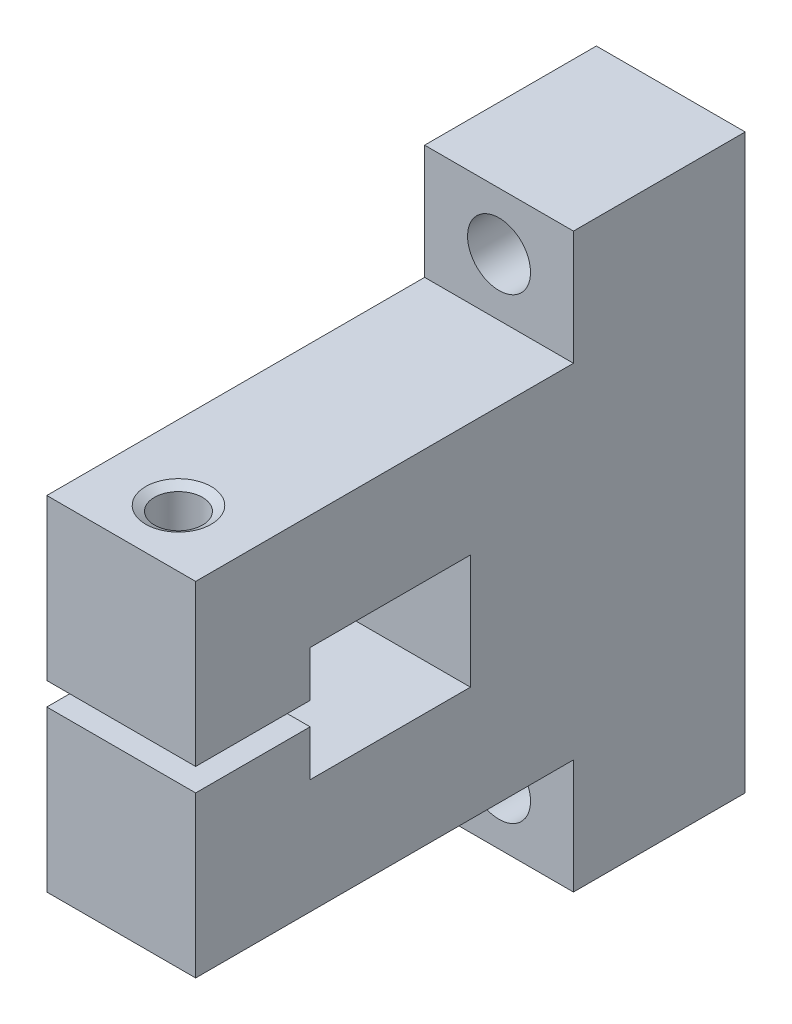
ISO-10303-21;
HEADER;
FILE_DESCRIPTION(('STEP AP214'),'2;1');
FILE_NAME('part.step','',(''),(''),'','','');
FILE_SCHEMA(('AUTOMOTIVE_DESIGN { 1 0 10303 214 1 1 1 1 }'));
ENDSEC;
DATA;
#1=APPLICATION_CONTEXT('core data for automotive mechanical design processes');
#2=APPLICATION_PROTOCOL_DEFINITION('international standard','automotive_design',2000,#1);
#3=PRODUCT_CONTEXT('',#1,'mechanical');
#4=PRODUCT('Part','Part','',(#3));
#5=PRODUCT_RELATED_PRODUCT_CATEGORY('part','',(#4));
#6=PRODUCT_DEFINITION_FORMATION('','',#4);
#7=PRODUCT_DEFINITION_CONTEXT('part definition',#1,'design');
#8=PRODUCT_DEFINITION('design','',#6,#7);
#9=PRODUCT_DEFINITION_SHAPE('','',#8);
#10=(LENGTH_UNIT() NAMED_UNIT(*) SI_UNIT(.MILLI.,.METRE.));
#11=(NAMED_UNIT(*) PLANE_ANGLE_UNIT() SI_UNIT($,.RADIAN.));
#12=(NAMED_UNIT(*) SI_UNIT($,.STERADIAN.) SOLID_ANGLE_UNIT());
#13=UNCERTAINTY_MEASURE_WITH_UNIT(LENGTH_MEASURE(1.E-05),#10,'distance_accuracy_value','');
#14=(GEOMETRIC_REPRESENTATION_CONTEXT(3) GLOBAL_UNCERTAINTY_ASSIGNED_CONTEXT((#13)) GLOBAL_UNIT_ASSIGNED_CONTEXT((#10,
#11,#12)) REPRESENTATION_CONTEXT('',''));
#15=CARTESIAN_POINT('',(0.,0.,0.));
#16=DIRECTION('',(0.,0.,1.));
#17=DIRECTION('',(1.,0.,0.));
#18=AXIS2_PLACEMENT_3D('',#15,#16,#17);
#19=CARTESIAN_POINT('',(6.5,0.,24.9999999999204));
#20=DIRECTION('',(0.,0.,-1.));
#21=DIRECTION('',(-1.,0.,0.));
#22=AXIS2_PLACEMENT_3D('',#19,#20,#21);
#23=CONICAL_SURFACE('',#22,2.49999999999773,1.02974425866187);
#24=CARTESIAN_POINT('',(6.5,-1.13686837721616E-10,26.5021515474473));
#25=VERTEX_POINT('',#24);
#26=VERTEX_LOOP('',#25);
#27=FACE_BOUND('',#26,.T.);
#28=CARTESIAN_POINT('',(6.5,0.,25.));
#29=DIRECTION('',(0.,0.,-1.));
#30=DIRECTION('',(0.,1.,0.));
#31=AXIS2_PLACEMENT_3D('',#28,#29,#30);
#32=CIRCLE('',#31,2.5);
#33=CARTESIAN_POINT('',(6.5,2.5,25.));
#34=VERTEX_POINT('',#33);
#35=EDGE_CURVE('E138',#34,#34,#32,.T.);
#36=ORIENTED_EDGE('',*,*,#35,.T.);
#37=EDGE_LOOP('',(#36));
#38=FACE_BOUND('',#37,.T.);
#39=ADVANCED_FACE('F16',(#27,#38),#23,.F.);
#40=CARTESIAN_POINT('',(6.5,-10.,58.));
#41=DIRECTION('',(0.,-1.,0.));
#42=DIRECTION('',(1.,0.,0.));
#43=AXIS2_PLACEMENT_3D('',#40,#41,#42);
#44=PLANE('',#43);
#45=CARTESIAN_POINT('',(6.5,-10.,58.));
#46=DIRECTION('',(0.,-1.,0.));
#47=DIRECTION('',(1.,0.,0.));
#48=AXIS2_PLACEMENT_3D('',#45,#46,#47);
#49=CIRCLE('',#48,2.75);
#50=CARTESIAN_POINT('',(9.25,-10.,58.));
#51=VERTEX_POINT('',#50);
#52=EDGE_CURVE('E143',#51,#51,#49,.F.);
#53=ORIENTED_EDGE('',*,*,#52,.T.);
#54=EDGE_LOOP('',(#53));
#55=FACE_BOUND('',#54,.T.);
#56=CARTESIAN_POINT('',(6.5,-10.,58.));
#57=DIRECTION('',(0.,-1.,0.));
#58=DIRECTION('',(1.,0.,0.));
#59=AXIS2_PLACEMENT_3D('',#56,#57,#58);
#60=CIRCLE('',#59,4.5);
#61=CARTESIAN_POINT('',(11.,-10.,58.));
#62=VERTEX_POINT('',#61);
#63=EDGE_CURVE('E19',#62,#62,#60,.T.);
#64=ORIENTED_EDGE('',*,*,#63,.T.);
#65=EDGE_LOOP('',(#64));
#66=FACE_BOUND('',#65,.T.);
#67=ADVANCED_FACE('F135',(#55,#66),#44,.T.);
#68=CARTESIAN_POINT('',(6.5,15.,58.));
#69=DIRECTION('',(0.,1.,0.));
#70=DIRECTION('',(-1.,0.,0.));
#71=AXIS2_PLACEMENT_3D('',#68,#69,#70);
#72=CYLINDRICAL_SURFACE('',#71,2.1);
#73=CARTESIAN_POINT('',(6.5,1.,58.));
#74=DIRECTION('',(0.,1.,0.));
#75=DIRECTION('',(-1.,0.,0.));
#76=AXIS2_PLACEMENT_3D('',#73,#74,#75);
#77=CIRCLE('',#76,2.1);
#78=CARTESIAN_POINT('',(4.4,1.,58.));
#79=VERTEX_POINT('',#78);
#80=EDGE_CURVE('E186',#79,#79,#77,.F.);
#81=ORIENTED_EDGE('',*,*,#80,.T.);
#82=EDGE_LOOP('',(#81));
#83=FACE_BOUND('',#82,.T.);
#84=CARTESIAN_POINT('',(6.5,14.5612137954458,58.));
#85=DIRECTION('',(0.,1.,0.));
#86=DIRECTION('',(1.,0.,0.));
#87=AXIS2_PLACEMENT_3D('',#84,#85,#86);
#88=CIRCLE('',#87,2.10000000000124);
#89=CARTESIAN_POINT('',(8.60000000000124,14.5612137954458,58.));
#90=VERTEX_POINT('',#89);
#91=EDGE_CURVE('E140',#90,#90,#88,.T.);
#92=ORIENTED_EDGE('',*,*,#91,.T.);
#93=EDGE_LOOP('',(#92));
#94=FACE_BOUND('',#93,.T.);
#95=ADVANCED_FACE('F428',(#83,#94),#72,.F.);
#96=CARTESIAN_POINT('',(6.5,14.9999999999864,58.));
#97=DIRECTION('',(0.,1.,0.));
#98=DIRECTION('',(0.,0.,1.));
#99=AXIS2_PLACEMENT_3D('',#96,#97,#98);
#100=CONICAL_SURFACE('',#99,2.85999999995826,1.04719755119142);
#101=CARTESIAN_POINT('',(6.5,15.0000000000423,58.));
#102=DIRECTION('',(0.,1.,0.));
#103=DIRECTION('',(0.,0.,1.));
#104=AXIS2_PLACEMENT_3D('',#101,#102,#103);
#105=CIRCLE('',#104,2.86000000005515);
#106=CARTESIAN_POINT('',(6.5,15.0000000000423,60.8600000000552));
#107=VERTEX_POINT('',#106);
#108=EDGE_CURVE('E181',#107,#107,#105,.T.);
#109=ORIENTED_EDGE('',*,*,#108,.T.);
#110=EDGE_LOOP('',(#109));
#111=FACE_BOUND('',#110,.T.);
#112=ORIENTED_EDGE('',*,*,#91,.F.);
#113=EDGE_LOOP('',(#112));
#114=FACE_BOUND('',#113,.T.);
#115=ADVANCED_FACE('F424',(#111,#114),#100,.F.);
#116=CARTESIAN_POINT('',(6.5,20.,30.));
#117=DIRECTION('',(0.,0.,1.));
#118=DIRECTION('',(0.,-1.,0.));
#119=AXIS2_PLACEMENT_3D('',#116,#117,#118);
#120=CYLINDRICAL_SURFACE('',#119,2.75);
#121=CARTESIAN_POINT('',(6.5,20.,15.));
#122=DIRECTION('',(0.,0.,1.));
#123=DIRECTION('',(0.,-1.,0.));
#124=AXIS2_PLACEMENT_3D('',#121,#122,#123);
#125=CIRCLE('',#124,2.75);
#126=CARTESIAN_POINT('',(6.5,17.25,15.));
#127=VERTEX_POINT('',#126);
#128=EDGE_CURVE('E169',#127,#127,#125,.F.);
#129=ORIENTED_EDGE('',*,*,#128,.T.);
#130=EDGE_LOOP('',(#129));
#131=FACE_BOUND('',#130,.T.);
#132=CARTESIAN_POINT('',(6.5,20.,30.));
#133=DIRECTION('',(0.,0.,1.));
#134=DIRECTION('',(0.,-1.,0.));
#135=AXIS2_PLACEMENT_3D('',#132,#133,#134);
#136=CIRCLE('',#135,2.75);
#137=CARTESIAN_POINT('',(6.5,17.25,30.));
#138=VERTEX_POINT('',#137);
#139=EDGE_CURVE('E176',#138,#138,#136,.F.);
#140=ORIENTED_EDGE('',*,*,#139,.F.);
#141=EDGE_LOOP('',(#140));
#142=FACE_BOUND('',#141,.T.);
#143=ADVANCED_FACE('F421',(#131,#142),#120,.F.);
#144=CARTESIAN_POINT('',(6.5,0.,15.));
#145=DIRECTION('',(0.,0.,-1.));
#146=DIRECTION('',(0.,1.,0.));
#147=AXIS2_PLACEMENT_3D('',#144,#145,#146);
#148=CYLINDRICAL_SURFACE('',#147,2.5);
#149=ORIENTED_EDGE('',*,*,#35,.F.);
#150=EDGE_LOOP('',(#149));
#151=FACE_BOUND('',#150,.T.);
#152=CARTESIAN_POINT('',(6.5,0.,15.));
#153=DIRECTION('',(0.,0.,-1.));
#154=DIRECTION('',(0.,1.,0.));
#155=AXIS2_PLACEMENT_3D('',#152,#153,#154);
#156=CIRCLE('',#155,2.5);
#157=CARTESIAN_POINT('',(6.5,2.50000000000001,15.));
#158=VERTEX_POINT('',#157);
#159=EDGE_CURVE('E165',#158,#158,#156,.T.);
#160=ORIENTED_EDGE('',*,*,#159,.T.);
#161=EDGE_LOOP('',(#160));
#162=FACE_BOUND('',#161,.T.);
#163=ADVANCED_FACE('F417',(#151,#162),#148,.F.);
#164=CARTESIAN_POINT('',(6.5,-20.,30.));
#165=DIRECTION('',(0.,0.,1.));
#166=DIRECTION('',(0.,-1.,0.));
#167=AXIS2_PLACEMENT_3D('',#164,#165,#166);
#168=CYLINDRICAL_SURFACE('',#167,2.75);
#169=CARTESIAN_POINT('',(6.5,-20.,15.));
#170=DIRECTION('',(0.,0.,1.));
#171=DIRECTION('',(0.,-1.,0.));
#172=AXIS2_PLACEMENT_3D('',#169,#170,#171);
#173=CIRCLE('',#172,2.75);
#174=CARTESIAN_POINT('',(6.5,-22.75,15.));
#175=VERTEX_POINT('',#174);
#176=EDGE_CURVE('E172',#175,#175,#173,.F.);
#177=ORIENTED_EDGE('',*,*,#176,.T.);
#178=EDGE_LOOP('',(#177));
#179=FACE_BOUND('',#178,.T.);
#180=CARTESIAN_POINT('',(6.5,-20.,30.));
#181=DIRECTION('',(0.,0.,1.));
#182=DIRECTION('',(0.,-1.,0.));
#183=AXIS2_PLACEMENT_3D('',#180,#181,#182);
#184=CIRCLE('',#183,2.75);
#185=CARTESIAN_POINT('',(6.5,-22.75,30.));
#186=VERTEX_POINT('',#185);
#187=EDGE_CURVE('E160',#186,#186,#184,.F.);
#188=ORIENTED_EDGE('',*,*,#187,.F.);
#189=EDGE_LOOP('',(#188));
#190=FACE_BOUND('',#189,.T.);
#191=ADVANCED_FACE('F413',(#179,#190),#168,.F.);
#192=CARTESIAN_POINT('',(6.5,-15.,58.));
#193=DIRECTION('',(0.,-1.,0.));
#194=DIRECTION('',(1.,0.,0.));
#195=AXIS2_PLACEMENT_3D('',#192,#193,#194);
#196=CYLINDRICAL_SURFACE('',#195,4.5);
#197=ORIENTED_EDGE('',*,*,#63,.F.);
#198=EDGE_LOOP('',(#197));
#199=FACE_BOUND('',#198,.T.);
#200=CARTESIAN_POINT('',(6.5,-15.,58.));
#201=DIRECTION('',(0.,-1.,0.));
#202=DIRECTION('',(1.,0.,0.));
#203=AXIS2_PLACEMENT_3D('',#200,#201,#202);
#204=CIRCLE('',#203,4.5);
#205=CARTESIAN_POINT('',(11.,-15.,58.));
#206=VERTEX_POINT('',#205);
#207=EDGE_CURVE('E155',#206,#206,#204,.T.);
#208=ORIENTED_EDGE('',*,*,#207,.T.);
#209=EDGE_LOOP('',(#208));
#210=FACE_BOUND('',#209,.T.);
#211=ADVANCED_FACE('F409',(#199,#210),#196,.F.);
#212=CARTESIAN_POINT('',(6.5,-15.,58.));
#213=DIRECTION('',(0.,-1.,0.));
#214=DIRECTION('',(1.,0.,0.));
#215=AXIS2_PLACEMENT_3D('',#212,#213,#214);
#216=CYLINDRICAL_SURFACE('',#215,2.75);
#217=CARTESIAN_POINT('',(6.5,-1.,58.));
#218=DIRECTION('',(0.,-1.,0.));
#219=DIRECTION('',(1.,0.,0.));
#220=AXIS2_PLACEMENT_3D('',#217,#218,#219);
#221=CIRCLE('',#220,2.75);
#222=CARTESIAN_POINT('',(9.25,-1.,58.));
#223=VERTEX_POINT('',#222);
#224=EDGE_CURVE('E150',#223,#223,#221,.F.);
#225=ORIENTED_EDGE('',*,*,#224,.T.);
#226=EDGE_LOOP('',(#225));
#227=FACE_BOUND('',#226,.T.);
#228=ORIENTED_EDGE('',*,*,#52,.F.);
#229=EDGE_LOOP('',(#228));
#230=FACE_BOUND('',#229,.T.);
#231=ADVANCED_FACE('F406',(#227,#230),#216,.F.);
#232=CARTESIAN_POINT('',(13.,0.,25.9999999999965));
#233=DIRECTION('',(-1.,0.,0.));
#234=DIRECTION('',(0.,-1.,0.));
#235=AXIS2_PLACEMENT_3D('',#232,#233,#234);
#236=PLANE('',#235);
#237=DIRECTION('',(0.,0.,-1.));
#238=VECTOR('',#237,1.);
#239=CARTESIAN_POINT('',(13.,-4.99999999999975,48.000000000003));
#240=LINE('',#239,#238);
#241=CARTESIAN_POINT('',(13.,-4.99999999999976,38.999999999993));
#242=VERTEX_POINT('',#241);
#243=CARTESIAN_POINT('',(13.,-4.99999999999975,52.999999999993));
#244=VERTEX_POINT('',#243);
#245=EDGE_CURVE('E245',#242,#244,#240,.F.);
#246=ORIENTED_EDGE('',*,*,#245,.T.);
#247=DIRECTION('',(0.,-1.,0.));
#248=VECTOR('',#247,1.);
#249=CARTESIAN_POINT('',(13.,6.00000000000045,52.999999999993));
#250=LINE('',#249,#248);
#251=CARTESIAN_POINT('',(13.,-1.,52.999999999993));
#252=VERTEX_POINT('',#251);
#253=EDGE_CURVE('E239',#244,#252,#250,.F.);
#254=ORIENTED_EDGE('',*,*,#253,.T.);
#255=DIRECTION('',(0.,0.,-1.));
#256=VECTOR('',#255,1.);
#257=CARTESIAN_POINT('',(13.,-1.,76.));
#258=LINE('',#257,#256);
#259=CARTESIAN_POINT('',(13.,-1.,63.));
#260=VERTEX_POINT('',#259);
#261=EDGE_CURVE('E153',#252,#260,#258,.F.);
#262=ORIENTED_EDGE('',*,*,#261,.T.);
#263=DIRECTION('',(0.,1.,0.));
#264=VECTOR('',#263,1.);
#265=CARTESIAN_POINT('',(13.,21.,63.));
#266=LINE('',#265,#264);
#267=CARTESIAN_POINT('',(13.,-15.,63.));
#268=VERTEX_POINT('',#267);
#269=EDGE_CURVE('E233',#260,#268,#266,.F.);
#270=ORIENTED_EDGE('',*,*,#269,.T.);
#271=DIRECTION('',(0.,0.,1.));
#272=VECTOR('',#271,1.);
#273=CARTESIAN_POINT('',(13.,-15.,64.));
#274=LINE('',#273,#272);
#275=CARTESIAN_POINT('',(13.,-15.,30.));
#276=VERTEX_POINT('',#275);
#277=EDGE_CURVE('E158',#268,#276,#274,.F.);
#278=ORIENTED_EDGE('',*,*,#277,.T.);
#279=DIRECTION('',(0.,-1.,0.));
#280=VECTOR('',#279,1.);
#281=CARTESIAN_POINT('',(13.,-25.,30.));
#282=LINE('',#281,#280);
#283=CARTESIAN_POINT('',(13.,-25.,30.));
#284=VERTEX_POINT('',#283);
#285=EDGE_CURVE('E159',#284,#276,#282,.F.);
#286=ORIENTED_EDGE('',*,*,#285,.F.);
#287=DIRECTION('',(0.,0.,-1.));
#288=VECTOR('',#287,1.);
#289=CARTESIAN_POINT('',(13.,-25.,23.));
#290=LINE('',#289,#288);
#291=CARTESIAN_POINT('',(13.,-25.,15.));
#292=VERTEX_POINT('',#291);
#293=EDGE_CURVE('E164',#292,#284,#290,.F.);
#294=ORIENTED_EDGE('',*,*,#293,.F.);
#295=DIRECTION('',(0.,-1.,0.));
#296=VECTOR('',#295,1.);
#297=CARTESIAN_POINT('',(13.,-21.,15.));
#298=LINE('',#297,#296);
#299=CARTESIAN_POINT('',(13.,25.,15.));
#300=VERTEX_POINT('',#299);
#301=EDGE_CURVE('E219',#292,#300,#298,.F.);
#302=ORIENTED_EDGE('',*,*,#301,.T.);
#303=DIRECTION('',(0.,0.,-1.));
#304=VECTOR('',#303,1.);
#305=CARTESIAN_POINT('',(13.,25.,-62.));
#306=LINE('',#305,#304);
#307=CARTESIAN_POINT('',(13.,25.,30.));
#308=VERTEX_POINT('',#307);
#309=EDGE_CURVE('E175',#300,#308,#306,.F.);
#310=ORIENTED_EDGE('',*,*,#309,.T.);
#311=DIRECTION('',(0.,-1.,0.));
#312=VECTOR('',#311,1.);
#313=CARTESIAN_POINT('',(13.,15.,30.));
#314=LINE('',#313,#312);
#315=CARTESIAN_POINT('',(13.,15.,30.));
#316=VERTEX_POINT('',#315);
#317=EDGE_CURVE('E212',#316,#308,#314,.F.);
#318=ORIENTED_EDGE('',*,*,#317,.F.);
#319=DIRECTION('',(0.,0.,-1.));
#320=VECTOR('',#319,1.);
#321=CARTESIAN_POINT('',(13.,15.,64.));
#322=LINE('',#321,#320);
#323=CARTESIAN_POINT('',(13.,15.,63.));
#324=VERTEX_POINT('',#323);
#325=EDGE_CURVE('E180',#316,#324,#322,.F.);
#326=ORIENTED_EDGE('',*,*,#325,.T.);
#327=DIRECTION('',(0.,1.,0.));
#328=VECTOR('',#327,1.);
#329=CARTESIAN_POINT('',(13.,21.,63.));
#330=LINE('',#329,#328);
#331=CARTESIAN_POINT('',(13.,1.,63.));
#332=VERTEX_POINT('',#331);
#333=EDGE_CURVE('E185',#324,#332,#330,.F.);
#334=ORIENTED_EDGE('',*,*,#333,.T.);
#335=DIRECTION('',(0.,0.,1.));
#336=VECTOR('',#335,1.);
#337=CARTESIAN_POINT('',(13.,1.,76.));
#338=LINE('',#337,#336);
#339=CARTESIAN_POINT('',(13.,1.,52.999999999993));
#340=VERTEX_POINT('',#339);
#341=EDGE_CURVE('E188',#332,#340,#338,.F.);
#342=ORIENTED_EDGE('',*,*,#341,.T.);
#343=DIRECTION('',(0.,-1.,0.));
#344=VECTOR('',#343,1.);
#345=CARTESIAN_POINT('',(13.,6.00000000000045,52.999999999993));
#346=LINE('',#345,#344);
#347=CARTESIAN_POINT('',(13.,5.00000000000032,52.999999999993));
#348=VERTEX_POINT('',#347);
#349=EDGE_CURVE('E195',#340,#348,#346,.F.);
#350=ORIENTED_EDGE('',*,*,#349,.T.);
#351=DIRECTION('',(0.,0.,1.));
#352=VECTOR('',#351,1.);
#353=CARTESIAN_POINT('',(13.,4.99999999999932,-1193.84071877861));
#354=LINE('',#353,#352);
#355=CARTESIAN_POINT('',(13.,5.00000000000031,38.999999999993));
#356=VERTEX_POINT('',#355);
#357=EDGE_CURVE('E129',#348,#356,#354,.F.);
#358=ORIENTED_EDGE('',*,*,#357,.T.);
#359=DIRECTION('',(0.,1.,0.));
#360=VECTOR('',#359,1.);
#361=CARTESIAN_POINT('',(13.,-5.99999999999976,38.999999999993));
#362=LINE('',#361,#360);
#363=EDGE_CURVE('E147',#356,#242,#362,.F.);
#364=ORIENTED_EDGE('',*,*,#363,.T.);
#365=EDGE_LOOP('',(#246,#254,#262,#270,#278,#286,#294,#302,#310,#318,#326,#334,#342,#350,#358,#364));
#366=FACE_BOUND('',#365,.T.);
#367=ADVANCED_FACE('F302',(#366),#236,.F.);
#368=CARTESIAN_POINT('',(14.9999999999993,-5.99999999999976,38.999999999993));
#369=DIRECTION('',(0.,0.,-1.));
#370=DIRECTION('',(0.,1.,0.));
#371=AXIS2_PLACEMENT_3D('',#368,#369,#370);
#372=PLANE('',#371);
#373=DIRECTION('',(1.,0.,0.));
#374=VECTOR('',#373,1.);
#375=CARTESIAN_POINT('',(-511.311282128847,5.00000000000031,38.9999999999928));
#376=LINE('',#375,#374);
#377=CARTESIAN_POINT('',(0.,5.00000000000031,38.999999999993));
#378=VERTEX_POINT('',#377);
#379=EDGE_CURVE('E194',#356,#378,#376,.F.);
#380=ORIENTED_EDGE('',*,*,#379,.T.);
#381=DIRECTION('',(0.,-1.,0.));
#382=VECTOR('',#381,1.);
#383=CARTESIAN_POINT('',(0.,0.,38.999999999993));
#384=LINE('',#383,#382);
#385=CARTESIAN_POINT('',(0.,-4.99999999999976,38.999999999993));
#386=VERTEX_POINT('',#385);
#387=EDGE_CURVE('E248',#386,#378,#384,.F.);
#388=ORIENTED_EDGE('',*,*,#387,.F.);
#389=DIRECTION('',(1.,0.,0.));
#390=VECTOR('',#389,1.);
#391=CARTESIAN_POINT('',(14.9999999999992,-4.99999999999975,38.999999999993));
#392=LINE('',#391,#390);
#393=EDGE_CURVE('E243',#386,#242,#392,.T.);
#394=ORIENTED_EDGE('',*,*,#393,.T.);
#395=ORIENTED_EDGE('',*,*,#363,.F.);
#396=EDGE_LOOP('',(#380,#388,#394,#395));
#397=FACE_BOUND('',#396,.T.);
#398=ADVANCED_FACE('F360',(#397),#372,.F.);
#399=CARTESIAN_POINT('',(-511.311282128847,4.99999999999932,-1193.84071877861));
#400=DIRECTION('',(0.,1.,0.));
#401=DIRECTION('',(0.,0.,1.));
#402=AXIS2_PLACEMENT_3D('',#399,#400,#401);
#403=PLANE('',#402);
#404=ORIENTED_EDGE('',*,*,#379,.F.);
#405=ORIENTED_EDGE('',*,*,#357,.F.);
#406=DIRECTION('',(1.,0.,0.));
#407=VECTOR('',#406,1.);
#408=CARTESIAN_POINT('',(14.9999999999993,5.00000000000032,52.999999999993));
#409=LINE('',#408,#407);
#410=CARTESIAN_POINT('',(0.,5.00000000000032,52.999999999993));
#411=VERTEX_POINT('',#410);
#412=EDGE_CURVE('E189',#348,#411,#409,.F.);
#413=ORIENTED_EDGE('',*,*,#412,.T.);
#414=DIRECTION('',(0.,0.,1.));
#415=VECTOR('',#414,1.);
#416=CARTESIAN_POINT('',(0.,5.00000000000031,25.9999999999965));
#417=LINE('',#416,#415);
#418=EDGE_CURVE('E251',#378,#411,#417,.T.);
#419=ORIENTED_EDGE('',*,*,#418,.F.);
#420=EDGE_LOOP('',(#404,#405,#413,#419));
#421=FACE_BOUND('',#420,.T.);
#422=ADVANCED_FACE('F358',(#421),#403,.F.);
#423=CARTESIAN_POINT('',(14.9999999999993,6.00000000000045,52.999999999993));
#424=DIRECTION('',(0.,0.,1.));
#425=DIRECTION('',(0.,-1.,0.));
#426=AXIS2_PLACEMENT_3D('',#423,#424,#425);
#427=PLANE('',#426);
#428=ORIENTED_EDGE('',*,*,#412,.F.);
#429=ORIENTED_EDGE('',*,*,#349,.F.);
#430=DIRECTION('',(1.,0.,0.));
#431=VECTOR('',#430,1.);
#432=CARTESIAN_POINT('',(-5.,1.,52.999999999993));
#433=LINE('',#432,#431);
#434=CARTESIAN_POINT('',(0.,1.,52.999999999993));
#435=VERTEX_POINT('',#434);
#436=EDGE_CURVE('E201',#340,#435,#433,.F.);
#437=ORIENTED_EDGE('',*,*,#436,.T.);
#438=DIRECTION('',(0.,-1.,0.));
#439=VECTOR('',#438,1.);
#440=CARTESIAN_POINT('',(0.,0.,52.999999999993));
#441=LINE('',#440,#439);
#442=EDGE_CURVE('E254',#411,#435,#441,.T.);
#443=ORIENTED_EDGE('',*,*,#442,.F.);
#444=EDGE_LOOP('',(#428,#429,#437,#443));
#445=FACE_BOUND('',#444,.T.);
#446=ADVANCED_FACE('F353',(#445),#427,.F.);
#447=CARTESIAN_POINT('',(-5.,1.,76.));
#448=DIRECTION('',(0.,1.,0.));
#449=DIRECTION('',(0.,0.,1.));
#450=AXIS2_PLACEMENT_3D('',#447,#448,#449);
#451=PLANE('',#450);
#452=ORIENTED_EDGE('',*,*,#341,.F.);
#453=DIRECTION('',(-1.,0.,0.));
#454=VECTOR('',#453,1.);
#455=CARTESIAN_POINT('',(15.,1.,63.));
#456=LINE('',#455,#454);
#457=CARTESIAN_POINT('',(0.,1.,63.));
#458=VERTEX_POINT('',#457);
#459=EDGE_CURVE('E203',#332,#458,#456,.T.);
#460=ORIENTED_EDGE('',*,*,#459,.T.);
#461=DIRECTION('',(0.,0.,1.));
#462=VECTOR('',#461,1.);
#463=CARTESIAN_POINT('',(0.,1.,25.9999999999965));
#464=LINE('',#463,#462);
#465=EDGE_CURVE('E257',#435,#458,#464,.T.);
#466=ORIENTED_EDGE('',*,*,#465,.F.);
#467=ORIENTED_EDGE('',*,*,#436,.F.);
#468=EDGE_LOOP('',(#452,#460,#466,#467));
#469=FACE_BOUND('',#468,.T.);
#470=ORIENTED_EDGE('',*,*,#80,.F.);
#471=EDGE_LOOP('',(#470));
#472=FACE_BOUND('',#471,.T.);
#473=ADVANCED_FACE('F347',(#469,#472),#451,.F.);
#474=CARTESIAN_POINT('',(15.,21.,63.));
#475=DIRECTION('',(0.,0.,-1.));
#476=DIRECTION('',(-1.,0.,0.));
#477=AXIS2_PLACEMENT_3D('',#474,#475,#476);
#478=PLANE('',#477);
#479=DIRECTION('',(1.,0.,0.));
#480=VECTOR('',#479,1.);
#481=CARTESIAN_POINT('',(-5.,15.,63.));
#482=LINE('',#481,#480);
#483=CARTESIAN_POINT('',(0.,15.,63.));
#484=VERTEX_POINT('',#483);
#485=EDGE_CURVE('E184',#324,#484,#482,.F.);
#486=ORIENTED_EDGE('',*,*,#485,.T.);
#487=DIRECTION('',(0.,-1.,0.));
#488=VECTOR('',#487,1.);
#489=CARTESIAN_POINT('',(0.,0.,63.));
#490=LINE('',#489,#488);
#491=EDGE_CURVE('E260',#458,#484,#490,.F.);
#492=ORIENTED_EDGE('',*,*,#491,.F.);
#493=ORIENTED_EDGE('',*,*,#459,.F.);
#494=ORIENTED_EDGE('',*,*,#333,.F.);
#495=EDGE_LOOP('',(#486,#492,#493,#494));
#496=FACE_BOUND('',#495,.T.);
#497=ADVANCED_FACE('F344',(#496),#478,.F.);
#498=CARTESIAN_POINT('',(-5.,15.,64.));
#499=DIRECTION('',(0.,-1.,0.));
#500=DIRECTION('',(0.,0.,-1.));
#501=AXIS2_PLACEMENT_3D('',#498,#499,#500);
#502=PLANE('',#501);
#503=DIRECTION('',(1.,0.,0.));
#504=VECTOR('',#503,1.);
#505=CARTESIAN_POINT('',(0.,15.,30.));
#506=LINE('',#505,#504);
#507=CARTESIAN_POINT('',(0.,15.,30.));
#508=VERTEX_POINT('',#507);
#509=EDGE_CURVE('E179',#508,#316,#506,.T.);
#510=ORIENTED_EDGE('',*,*,#509,.F.);
#511=DIRECTION('',(0.,0.,1.));
#512=VECTOR('',#511,1.);
#513=CARTESIAN_POINT('',(0.,15.,25.9999999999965));
#514=LINE('',#513,#512);
#515=EDGE_CURVE('E263',#484,#508,#514,.F.);
#516=ORIENTED_EDGE('',*,*,#515,.F.);
#517=ORIENTED_EDGE('',*,*,#485,.F.);
#518=ORIENTED_EDGE('',*,*,#325,.F.);
#519=EDGE_LOOP('',(#510,#516,#517,#518));
#520=FACE_BOUND('',#519,.T.);
#521=ORIENTED_EDGE('',*,*,#108,.F.);
#522=EDGE_LOOP('',(#521));
#523=FACE_BOUND('',#522,.T.);
#524=ADVANCED_FACE('F340',(#520,#523),#502,.F.);
#525=CARTESIAN_POINT('',(0.,15.,30.));
#526=DIRECTION('',(0.,0.,1.));
#527=DIRECTION('',(0.,-1.,0.));
#528=AXIS2_PLACEMENT_3D('',#525,#526,#527);
#529=PLANE('',#528);
#530=ORIENTED_EDGE('',*,*,#317,.T.);
#531=DIRECTION('',(1.,0.,0.));
#532=VECTOR('',#531,1.);
#533=CARTESIAN_POINT('',(15.,25.,30.));
#534=LINE('',#533,#532);
#535=CARTESIAN_POINT('',(0.,25.,30.));
#536=VERTEX_POINT('',#535);
#537=EDGE_CURVE('E214',#308,#536,#534,.F.);
#538=ORIENTED_EDGE('',*,*,#537,.T.);
#539=DIRECTION('',(0.,-1.,0.));
#540=VECTOR('',#539,1.);
#541=CARTESIAN_POINT('',(0.,0.,30.));
#542=LINE('',#541,#540);
#543=EDGE_CURVE('E266',#508,#536,#542,.F.);
#544=ORIENTED_EDGE('',*,*,#543,.F.);
#545=ORIENTED_EDGE('',*,*,#509,.T.);
#546=EDGE_LOOP('',(#530,#538,#544,#545));
#547=FACE_BOUND('',#546,.T.);
#548=ORIENTED_EDGE('',*,*,#139,.T.);
#549=EDGE_LOOP('',(#548));
#550=FACE_BOUND('',#549,.T.);
#551=ADVANCED_FACE('F334',(#547,#550),#529,.T.);
#552=CARTESIAN_POINT('',(15.,25.,-62.));
#553=DIRECTION('',(0.,-1.,0.));
#554=DIRECTION('',(0.,0.,-1.));
#555=AXIS2_PLACEMENT_3D('',#552,#553,#554);
#556=PLANE('',#555);
#557=DIRECTION('',(1.,0.,0.));
#558=VECTOR('',#557,1.);
#559=CARTESIAN_POINT('',(-15.,25.,15.));
#560=LINE('',#559,#558);
#561=CARTESIAN_POINT('',(0.,25.,15.));
#562=VERTEX_POINT('',#561);
#563=EDGE_CURVE('E168',#300,#562,#560,.F.);
#564=ORIENTED_EDGE('',*,*,#563,.T.);
#565=DIRECTION('',(0.,0.,1.));
#566=VECTOR('',#565,1.);
#567=CARTESIAN_POINT('',(0.,25.,25.9999999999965));
#568=LINE('',#567,#566);
#569=EDGE_CURVE('E269',#536,#562,#568,.F.);
#570=ORIENTED_EDGE('',*,*,#569,.F.);
#571=ORIENTED_EDGE('',*,*,#537,.F.);
#572=ORIENTED_EDGE('',*,*,#309,.F.);
#573=EDGE_LOOP('',(#564,#570,#571,#572));
#574=FACE_BOUND('',#573,.T.);
#575=ADVANCED_FACE('F331',(#574),#556,.F.);
#576=CARTESIAN_POINT('',(-15.,-21.,15.));
#577=DIRECTION('',(0.,0.,1.));
#578=DIRECTION('',(0.,-1.,0.));
#579=AXIS2_PLACEMENT_3D('',#576,#577,#578);
#580=PLANE('',#579);
#581=DIRECTION('',(1.,0.,0.));
#582=VECTOR('',#581,1.);
#583=CARTESIAN_POINT('',(0.,-25.,15.));
#584=LINE('',#583,#582);
#585=CARTESIAN_POINT('',(0.,-25.,15.));
#586=VERTEX_POINT('',#585);
#587=EDGE_CURVE('E222',#586,#292,#584,.T.);
#588=ORIENTED_EDGE('',*,*,#587,.F.);
#589=DIRECTION('',(0.,-1.,0.));
#590=VECTOR('',#589,1.);
#591=CARTESIAN_POINT('',(0.,0.,15.));
#592=LINE('',#591,#590);
#593=EDGE_CURVE('E272',#562,#586,#592,.T.);
#594=ORIENTED_EDGE('',*,*,#593,.F.);
#595=ORIENTED_EDGE('',*,*,#563,.F.);
#596=ORIENTED_EDGE('',*,*,#301,.F.);
#597=EDGE_LOOP('',(#588,#594,#595,#596));
#598=FACE_BOUND('',#597,.T.);
#599=ORIENTED_EDGE('',*,*,#159,.F.);
#600=EDGE_LOOP('',(#599));
#601=FACE_BOUND('',#600,.T.);
#602=ORIENTED_EDGE('',*,*,#128,.F.);
#603=EDGE_LOOP('',(#602));
#604=FACE_BOUND('',#603,.T.);
#605=ORIENTED_EDGE('',*,*,#176,.F.);
#606=EDGE_LOOP('',(#605));
#607=FACE_BOUND('',#606,.T.);
#608=ADVANCED_FACE('F327',(#598,#601,#604,#607),#580,.F.);
#609=CARTESIAN_POINT('',(0.,-25.,23.));
#610=DIRECTION('',(0.,-1.,0.));
#611=DIRECTION('',(0.,0.,-1.));
#612=AXIS2_PLACEMENT_3D('',#609,#610,#611);
#613=PLANE('',#612);
#614=ORIENTED_EDGE('',*,*,#293,.T.);
#615=DIRECTION('',(1.,0.,0.));
#616=VECTOR('',#615,1.);
#617=CARTESIAN_POINT('',(0.,-25.,30.));
#618=LINE('',#617,#616);
#619=CARTESIAN_POINT('',(0.,-25.,30.));
#620=VERTEX_POINT('',#619);
#621=EDGE_CURVE('E163',#620,#284,#618,.T.);
#622=ORIENTED_EDGE('',*,*,#621,.F.);
#623=DIRECTION('',(0.,0.,1.));
#624=VECTOR('',#623,1.);
#625=CARTESIAN_POINT('',(0.,-25.,25.9999999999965));
#626=LINE('',#625,#624);
#627=EDGE_CURVE('E275',#586,#620,#626,.T.);
#628=ORIENTED_EDGE('',*,*,#627,.F.);
#629=ORIENTED_EDGE('',*,*,#587,.T.);
#630=EDGE_LOOP('',(#614,#622,#628,#629));
#631=FACE_BOUND('',#630,.T.);
#632=ADVANCED_FACE('F321',(#631),#613,.T.);
#633=CARTESIAN_POINT('',(0.,-25.,30.));
#634=DIRECTION('',(0.,0.,1.));
#635=DIRECTION('',(0.,-1.,0.));
#636=AXIS2_PLACEMENT_3D('',#633,#634,#635);
#637=PLANE('',#636);
#638=ORIENTED_EDGE('',*,*,#285,.T.);
#639=DIRECTION('',(1.,0.,0.));
#640=VECTOR('',#639,1.);
#641=CARTESIAN_POINT('',(-5.,-15.,30.));
#642=LINE('',#641,#640);
#643=CARTESIAN_POINT('',(0.,-15.,30.));
#644=VERTEX_POINT('',#643);
#645=EDGE_CURVE('E231',#276,#644,#642,.F.);
#646=ORIENTED_EDGE('',*,*,#645,.T.);
#647=DIRECTION('',(0.,-1.,0.));
#648=VECTOR('',#647,1.);
#649=CARTESIAN_POINT('',(0.,0.,30.));
#650=LINE('',#649,#648);
#651=EDGE_CURVE('E278',#620,#644,#650,.F.);
#652=ORIENTED_EDGE('',*,*,#651,.F.);
#653=ORIENTED_EDGE('',*,*,#621,.T.);
#654=EDGE_LOOP('',(#638,#646,#652,#653));
#655=FACE_BOUND('',#654,.T.);
#656=ORIENTED_EDGE('',*,*,#187,.T.);
#657=EDGE_LOOP('',(#656));
#658=FACE_BOUND('',#657,.T.);
#659=ADVANCED_FACE('F316',(#655,#658),#637,.T.);
#660=CARTESIAN_POINT('',(-5.,-15.,64.));
#661=DIRECTION('',(0.,1.,0.));
#662=DIRECTION('',(0.,0.,1.));
#663=AXIS2_PLACEMENT_3D('',#660,#661,#662);
#664=PLANE('',#663);
#665=ORIENTED_EDGE('',*,*,#645,.F.);
#666=ORIENTED_EDGE('',*,*,#277,.F.);
#667=DIRECTION('',(-1.,0.,0.));
#668=VECTOR('',#667,1.);
#669=CARTESIAN_POINT('',(15.,-15.,63.));
#670=LINE('',#669,#668);
#671=CARTESIAN_POINT('',(0.,-15.,63.));
#672=VERTEX_POINT('',#671);
#673=EDGE_CURVE('E154',#268,#672,#670,.T.);
#674=ORIENTED_EDGE('',*,*,#673,.T.);
#675=DIRECTION('',(0.,0.,1.));
#676=VECTOR('',#675,1.);
#677=CARTESIAN_POINT('',(0.,-15.,25.9999999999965));
#678=LINE('',#677,#676);
#679=EDGE_CURVE('E281',#644,#672,#678,.T.);
#680=ORIENTED_EDGE('',*,*,#679,.F.);
#681=EDGE_LOOP('',(#665,#666,#674,#680));
#682=FACE_BOUND('',#681,.T.);
#683=ORIENTED_EDGE('',*,*,#207,.F.);
#684=EDGE_LOOP('',(#683));
#685=FACE_BOUND('',#684,.T.);
#686=ADVANCED_FACE('F311',(#682,#685),#664,.F.);
#687=CARTESIAN_POINT('',(15.,21.,63.));
#688=DIRECTION('',(0.,0.,-1.));
#689=DIRECTION('',(-1.,0.,0.));
#690=AXIS2_PLACEMENT_3D('',#687,#688,#689);
#691=PLANE('',#690);
#692=ORIENTED_EDGE('',*,*,#673,.F.);
#693=ORIENTED_EDGE('',*,*,#269,.F.);
#694=DIRECTION('',(1.,0.,0.));
#695=VECTOR('',#694,1.);
#696=CARTESIAN_POINT('',(-5.,-1.,63.));
#697=LINE('',#696,#695);
#698=CARTESIAN_POINT('',(0.,-1.,63.));
#699=VERTEX_POINT('',#698);
#700=EDGE_CURVE('E237',#260,#699,#697,.F.);
#701=ORIENTED_EDGE('',*,*,#700,.T.);
#702=DIRECTION('',(0.,-1.,0.));
#703=VECTOR('',#702,1.);
#704=CARTESIAN_POINT('',(0.,0.,63.));
#705=LINE('',#704,#703);
#706=EDGE_CURVE('E284',#672,#699,#705,.F.);
#707=ORIENTED_EDGE('',*,*,#706,.F.);
#708=EDGE_LOOP('',(#692,#693,#701,#707));
#709=FACE_BOUND('',#708,.T.);
#710=ADVANCED_FACE('F306',(#709),#691,.F.);
#711=CARTESIAN_POINT('',(-5.,-1.,76.));
#712=DIRECTION('',(0.,-1.,0.));
#713=DIRECTION('',(0.,0.,-1.));
#714=AXIS2_PLACEMENT_3D('',#711,#712,#713);
#715=PLANE('',#714);
#716=ORIENTED_EDGE('',*,*,#700,.F.);
#717=ORIENTED_EDGE('',*,*,#261,.F.);
#718=DIRECTION('',(1.,0.,0.));
#719=VECTOR('',#718,1.);
#720=CARTESIAN_POINT('',(14.9999999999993,-1.,52.999999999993));
#721=LINE('',#720,#719);
#722=CARTESIAN_POINT('',(0.,-1.,52.999999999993));
#723=VERTEX_POINT('',#722);
#724=EDGE_CURVE('E241',#252,#723,#721,.F.);
#725=ORIENTED_EDGE('',*,*,#724,.T.);
#726=DIRECTION('',(0.,0.,1.));
#727=VECTOR('',#726,1.);
#728=CARTESIAN_POINT('',(0.,-1.,25.9999999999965));
#729=LINE('',#728,#727);
#730=EDGE_CURVE('E287',#699,#723,#729,.F.);
#731=ORIENTED_EDGE('',*,*,#730,.F.);
#732=EDGE_LOOP('',(#716,#717,#725,#731));
#733=FACE_BOUND('',#732,.T.);
#734=ORIENTED_EDGE('',*,*,#224,.F.);
#735=EDGE_LOOP('',(#734));
#736=FACE_BOUND('',#735,.T.);
#737=ADVANCED_FACE('F299',(#733,#736),#715,.F.);
#738=CARTESIAN_POINT('',(14.9999999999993,6.00000000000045,52.999999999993));
#739=DIRECTION('',(0.,0.,1.));
#740=DIRECTION('',(0.,-1.,0.));
#741=AXIS2_PLACEMENT_3D('',#738,#739,#740);
#742=PLANE('',#741);
#743=ORIENTED_EDGE('',*,*,#253,.F.);
#744=DIRECTION('',(1.,0.,0.));
#745=VECTOR('',#744,1.);
#746=CARTESIAN_POINT('',(14.9999999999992,-4.99999999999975,52.999999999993));
#747=LINE('',#746,#745);
#748=CARTESIAN_POINT('',(0.,-4.99999999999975,52.999999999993));
#749=VERTEX_POINT('',#748);
#750=EDGE_CURVE('E34',#244,#749,#747,.F.);
#751=ORIENTED_EDGE('',*,*,#750,.T.);
#752=DIRECTION('',(0.,-1.,0.));
#753=VECTOR('',#752,1.);
#754=CARTESIAN_POINT('',(0.,0.,52.999999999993));
#755=LINE('',#754,#753);
#756=EDGE_CURVE('E25',#723,#749,#755,.T.);
#757=ORIENTED_EDGE('',*,*,#756,.F.);
#758=ORIENTED_EDGE('',*,*,#724,.F.);
#759=EDGE_LOOP('',(#743,#751,#757,#758));
#760=FACE_BOUND('',#759,.T.);
#761=ADVANCED_FACE('F295',(#760),#742,.F.);
#762=CARTESIAN_POINT('',(14.9999999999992,-4.99999999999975,48.000000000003));
#763=DIRECTION('',(0.,-1.,0.));
#764=DIRECTION('',(0.,0.,-1.));
#765=AXIS2_PLACEMENT_3D('',#762,#763,#764);
#766=PLANE('',#765);
#767=ORIENTED_EDGE('',*,*,#750,.F.);
#768=ORIENTED_EDGE('',*,*,#245,.F.);
#769=ORIENTED_EDGE('',*,*,#393,.F.);
#770=DIRECTION('',(0.,0.,1.));
#771=VECTOR('',#770,1.);
#772=CARTESIAN_POINT('',(0.,-4.99999999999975,25.9999999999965));
#773=LINE('',#772,#771);
#774=EDGE_CURVE('E11',#749,#386,#773,.F.);
#775=ORIENTED_EDGE('',*,*,#774,.F.);
#776=EDGE_LOOP('',(#767,#768,#769,#775));
#777=FACE_BOUND('',#776,.T.);
#778=ADVANCED_FACE('F364',(#777),#766,.F.);
#779=CARTESIAN_POINT('',(0.,0.,25.9999999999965));
#780=DIRECTION('',(-1.,0.,0.));
#781=DIRECTION('',(0.,-1.,0.));
#782=AXIS2_PLACEMENT_3D('',#779,#780,#781);
#783=PLANE('',#782);
#784=ORIENTED_EDGE('',*,*,#756,.T.);
#785=ORIENTED_EDGE('',*,*,#774,.T.);
#786=ORIENTED_EDGE('',*,*,#387,.T.);
#787=ORIENTED_EDGE('',*,*,#418,.T.);
#788=ORIENTED_EDGE('',*,*,#442,.T.);
#789=ORIENTED_EDGE('',*,*,#465,.T.);
#790=ORIENTED_EDGE('',*,*,#491,.T.);
#791=ORIENTED_EDGE('',*,*,#515,.T.);
#792=ORIENTED_EDGE('',*,*,#543,.T.);
#793=ORIENTED_EDGE('',*,*,#569,.T.);
#794=ORIENTED_EDGE('',*,*,#593,.T.);
#795=ORIENTED_EDGE('',*,*,#627,.T.);
#796=ORIENTED_EDGE('',*,*,#651,.T.);
#797=ORIENTED_EDGE('',*,*,#679,.T.);
#798=ORIENTED_EDGE('',*,*,#706,.T.);
#799=ORIENTED_EDGE('',*,*,#730,.T.);
#800=EDGE_LOOP('',(#784,#785,#786,#787,#788,#789,#790,#791,#792,#793,#794,#795,#796,#797,#798,#799));
#801=FACE_BOUND('',#800,.T.);
#802=ADVANCED_FACE('F292',(#801),#783,.T.);
#803=CLOSED_SHELL('',(#39,#67,#95,#115,#143,#163,#191,#211,#231,#367,#398,#422,#446,#473,#497,
#524,#551,#575,#608,#632,#659,#686,#710,#737,#761,#778,#802));
#804=MANIFOLD_SOLID_BREP('B1',#803);
#805=ADVANCED_BREP_SHAPE_REPRESENTATION('',(#18,#804),#14);
#806=SHAPE_DEFINITION_REPRESENTATION(#9,#805);
ENDSEC;
END-ISO-10303-21;
